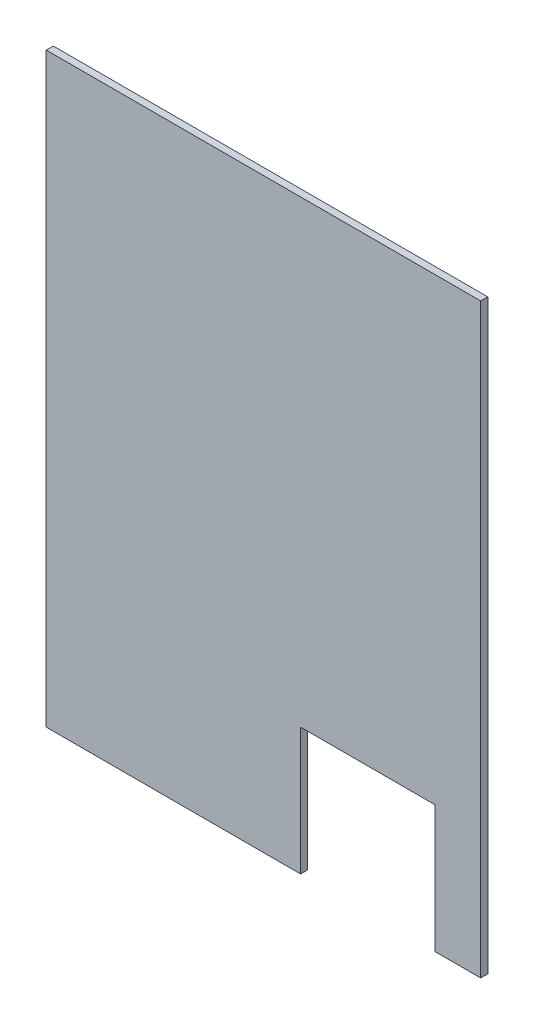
ISO-10303-21;
HEADER;
FILE_DESCRIPTION(('STEP AP214'),'2;1');
FILE_NAME('part.step','',(''),(''),'','','');
FILE_SCHEMA(('AUTOMOTIVE_DESIGN { 1 0 10303 214 1 1 1 1 }'));
ENDSEC;
DATA;
#1=APPLICATION_CONTEXT('core data for automotive mechanical design processes');
#2=APPLICATION_PROTOCOL_DEFINITION('international standard','automotive_design',2000,#1);
#3=PRODUCT_CONTEXT('',#1,'mechanical');
#4=PRODUCT('Part','Part','',(#3));
#5=PRODUCT_RELATED_PRODUCT_CATEGORY('part','',(#4));
#6=PRODUCT_DEFINITION_FORMATION('','',#4);
#7=PRODUCT_DEFINITION_CONTEXT('part definition',#1,'design');
#8=PRODUCT_DEFINITION('design','',#6,#7);
#9=PRODUCT_DEFINITION_SHAPE('','',#8);
#10=(LENGTH_UNIT() NAMED_UNIT(*) SI_UNIT(.MILLI.,.METRE.));
#11=(NAMED_UNIT(*) PLANE_ANGLE_UNIT() SI_UNIT($,.RADIAN.));
#12=(NAMED_UNIT(*) SI_UNIT($,.STERADIAN.) SOLID_ANGLE_UNIT());
#13=UNCERTAINTY_MEASURE_WITH_UNIT(LENGTH_MEASURE(1.E-05),#10,'distance_accuracy_value','');
#14=(GEOMETRIC_REPRESENTATION_CONTEXT(3) GLOBAL_UNCERTAINTY_ASSIGNED_CONTEXT((#13)) GLOBAL_UNIT_ASSIGNED_CONTEXT((#10,
#11,#12)) REPRESENTATION_CONTEXT('',''));
#15=CARTESIAN_POINT('',(0.,0.,0.));
#16=DIRECTION('',(0.,0.,1.));
#17=DIRECTION('',(1.,0.,0.));
#18=AXIS2_PLACEMENT_3D('',#15,#16,#17);
#19=CARTESIAN_POINT('',(0.,0.,10.));
#20=DIRECTION('',(1.,0.,0.));
#21=DIRECTION('',(0.,0.,-1.));
#22=AXIS2_PLACEMENT_3D('',#19,#20,#21);
#23=PLANE('',#22);
#24=DIRECTION('',(0.,-1.,0.));
#25=VECTOR('',#24,1.);
#26=CARTESIAN_POINT('',(0.,0.,0.));
#27=LINE('',#26,#25);
#28=CARTESIAN_POINT('',(0.,830.,0.));
#29=VERTEX_POINT('',#28);
#30=CARTESIAN_POINT('',(0.,0.,0.));
#31=VERTEX_POINT('',#30);
#32=EDGE_CURVE('E139',#29,#31,#27,.T.);
#33=ORIENTED_EDGE('',*,*,#32,.T.);
#34=DIRECTION('',(0.,0.,-1.));
#35=VECTOR('',#34,1.);
#36=CARTESIAN_POINT('',(0.,0.,10.));
#37=LINE('',#36,#35);
#38=CARTESIAN_POINT('',(0.,0.,10.));
#39=VERTEX_POINT('',#38);
#40=EDGE_CURVE('E11',#39,#31,#37,.T.);
#41=ORIENTED_EDGE('',*,*,#40,.F.);
#42=DIRECTION('',(0.,-1.,0.));
#43=VECTOR('',#42,1.);
#44=CARTESIAN_POINT('',(0.,0.,10.));
#45=LINE('',#44,#43);
#46=CARTESIAN_POINT('',(0.,830.,10.));
#47=VERTEX_POINT('',#46);
#48=EDGE_CURVE('E160',#47,#39,#45,.T.);
#49=ORIENTED_EDGE('',*,*,#48,.F.);
#50=DIRECTION('',(0.,0.,-1.));
#51=VECTOR('',#50,1.);
#52=CARTESIAN_POINT('',(0.,830.,10.));
#53=LINE('',#52,#51);
#54=EDGE_CURVE('E135',#47,#29,#53,.T.);
#55=ORIENTED_EDGE('',*,*,#54,.T.);
#56=EDGE_LOOP('',(#33,#41,#49,#55));
#57=FACE_BOUND('',#56,.T.);
#58=ADVANCED_FACE('F36',(#57),#23,.F.);
#59=CARTESIAN_POINT('',(0.,0.,10.));
#60=DIRECTION('',(0.,1.,0.));
#61=DIRECTION('',(-1.,0.,0.));
#62=AXIS2_PLACEMENT_3D('',#59,#60,#61);
#63=PLANE('',#62);
#64=DIRECTION('',(1.,0.,0.));
#65=VECTOR('',#64,1.);
#66=CARTESIAN_POINT('',(0.,0.,0.));
#67=LINE('',#66,#65);
#68=CARTESIAN_POINT('',(360.,0.,0.));
#69=VERTEX_POINT('',#68);
#70=EDGE_CURVE('E142',#31,#69,#67,.T.);
#71=ORIENTED_EDGE('',*,*,#70,.T.);
#72=DIRECTION('',(0.,0.,-1.));
#73=VECTOR('',#72,1.);
#74=CARTESIAN_POINT('',(360.,0.,10.));
#75=LINE('',#74,#73);
#76=CARTESIAN_POINT('',(360.,0.,10.));
#77=VERTEX_POINT('',#76);
#78=EDGE_CURVE('E45',#77,#69,#75,.T.);
#79=ORIENTED_EDGE('',*,*,#78,.F.);
#80=DIRECTION('',(1.,0.,0.));
#81=VECTOR('',#80,1.);
#82=CARTESIAN_POINT('',(0.,0.,10.));
#83=LINE('',#82,#81);
#84=EDGE_CURVE('E96',#39,#77,#83,.T.);
#85=ORIENTED_EDGE('',*,*,#84,.F.);
#86=ORIENTED_EDGE('',*,*,#40,.T.);
#87=EDGE_LOOP('',(#71,#79,#85,#86));
#88=FACE_BOUND('',#87,.T.);
#89=ADVANCED_FACE('F205',(#88),#63,.F.);
#90=CARTESIAN_POINT('',(360.,0.,10.));
#91=DIRECTION('',(-1.,0.,0.));
#92=DIRECTION('',(0.,-1.,0.));
#93=AXIS2_PLACEMENT_3D('',#90,#91,#92);
#94=PLANE('',#93);
#95=DIRECTION('',(0.,1.,0.));
#96=VECTOR('',#95,1.);
#97=CARTESIAN_POINT('',(360.,0.,0.));
#98=LINE('',#97,#96);
#99=CARTESIAN_POINT('',(360.,180.,0.));
#100=VERTEX_POINT('',#99);
#101=EDGE_CURVE('E145',#69,#100,#98,.T.);
#102=ORIENTED_EDGE('',*,*,#101,.T.);
#103=DIRECTION('',(0.,0.,-1.));
#104=VECTOR('',#103,1.);
#105=CARTESIAN_POINT('',(360.,180.,10.));
#106=LINE('',#105,#104);
#107=CARTESIAN_POINT('',(360.,180.,10.));
#108=VERTEX_POINT('',#107);
#109=EDGE_CURVE('E171',#108,#100,#106,.T.);
#110=ORIENTED_EDGE('',*,*,#109,.F.);
#111=DIRECTION('',(0.,1.,0.));
#112=VECTOR('',#111,1.);
#113=CARTESIAN_POINT('',(360.,0.,10.));
#114=LINE('',#113,#112);
#115=EDGE_CURVE('E181',#77,#108,#114,.T.);
#116=ORIENTED_EDGE('',*,*,#115,.F.);
#117=ORIENTED_EDGE('',*,*,#78,.T.);
#118=EDGE_LOOP('',(#102,#110,#116,#117));
#119=FACE_BOUND('',#118,.T.);
#120=ADVANCED_FACE('F179',(#119),#94,.F.);
#121=CARTESIAN_POINT('',(360.,180.,10.));
#122=DIRECTION('',(0.,1.,0.));
#123=DIRECTION('',(-1.,0.,0.));
#124=AXIS2_PLACEMENT_3D('',#121,#122,#123);
#125=PLANE('',#124);
#126=DIRECTION('',(1.,0.,0.));
#127=VECTOR('',#126,1.);
#128=CARTESIAN_POINT('',(360.,180.,0.));
#129=LINE('',#128,#127);
#130=CARTESIAN_POINT('',(550.,180.,0.));
#131=VERTEX_POINT('',#130);
#132=EDGE_CURVE('E148',#100,#131,#129,.T.);
#133=ORIENTED_EDGE('',*,*,#132,.T.);
#134=DIRECTION('',(0.,0.,-1.));
#135=VECTOR('',#134,1.);
#136=CARTESIAN_POINT('',(550.,180.,10.));
#137=LINE('',#136,#135);
#138=CARTESIAN_POINT('',(550.,180.,10.));
#139=VERTEX_POINT('',#138);
#140=EDGE_CURVE('E167',#139,#131,#137,.T.);
#141=ORIENTED_EDGE('',*,*,#140,.F.);
#142=DIRECTION('',(1.,0.,0.));
#143=VECTOR('',#142,1.);
#144=CARTESIAN_POINT('',(360.,180.,10.));
#145=LINE('',#144,#143);
#146=EDGE_CURVE('E194',#108,#139,#145,.T.);
#147=ORIENTED_EDGE('',*,*,#146,.F.);
#148=ORIENTED_EDGE('',*,*,#109,.T.);
#149=EDGE_LOOP('',(#133,#141,#147,#148));
#150=FACE_BOUND('',#149,.T.);
#151=ADVANCED_FACE('F189',(#150),#125,.F.);
#152=CARTESIAN_POINT('',(550.,180.,10.));
#153=DIRECTION('',(1.,0.,0.));
#154=DIRECTION('',(0.,1.,0.));
#155=AXIS2_PLACEMENT_3D('',#152,#153,#154);
#156=PLANE('',#155);
#157=DIRECTION('',(0.,-1.,0.));
#158=VECTOR('',#157,1.);
#159=CARTESIAN_POINT('',(550.,180.,0.));
#160=LINE('',#159,#158);
#161=CARTESIAN_POINT('',(550.,0.,0.));
#162=VERTEX_POINT('',#161);
#163=EDGE_CURVE('E151',#131,#162,#160,.T.);
#164=ORIENTED_EDGE('',*,*,#163,.T.);
#165=DIRECTION('',(0.,0.,-1.));
#166=VECTOR('',#165,1.);
#167=CARTESIAN_POINT('',(550.,0.,10.));
#168=LINE('',#167,#166);
#169=CARTESIAN_POINT('',(550.,0.,10.));
#170=VERTEX_POINT('',#169);
#171=EDGE_CURVE('E126',#170,#162,#168,.T.);
#172=ORIENTED_EDGE('',*,*,#171,.F.);
#173=DIRECTION('',(0.,-1.,0.));
#174=VECTOR('',#173,1.);
#175=CARTESIAN_POINT('',(550.,180.,10.));
#176=LINE('',#175,#174);
#177=EDGE_CURVE('E115',#139,#170,#176,.T.);
#178=ORIENTED_EDGE('',*,*,#177,.F.);
#179=ORIENTED_EDGE('',*,*,#140,.T.);
#180=EDGE_LOOP('',(#164,#172,#178,#179));
#181=FACE_BOUND('',#180,.T.);
#182=ADVANCED_FACE('F192',(#181),#156,.F.);
#183=CARTESIAN_POINT('',(550.,0.,10.));
#184=DIRECTION('',(0.,1.,0.));
#185=DIRECTION('',(-1.,0.,0.));
#186=AXIS2_PLACEMENT_3D('',#183,#184,#185);
#187=PLANE('',#186);
#188=DIRECTION('',(1.,0.,0.));
#189=VECTOR('',#188,1.);
#190=CARTESIAN_POINT('',(550.,0.,0.));
#191=LINE('',#190,#189);
#192=CARTESIAN_POINT('',(615.,0.,0.));
#193=VERTEX_POINT('',#192);
#194=EDGE_CURVE('E124',#162,#193,#191,.T.);
#195=ORIENTED_EDGE('',*,*,#194,.T.);
#196=DIRECTION('',(0.,0.,-1.));
#197=VECTOR('',#196,1.);
#198=CARTESIAN_POINT('',(615.,0.,10.));
#199=LINE('',#198,#197);
#200=CARTESIAN_POINT('',(615.,0.,10.));
#201=VERTEX_POINT('',#200);
#202=EDGE_CURVE('E121',#201,#193,#199,.T.);
#203=ORIENTED_EDGE('',*,*,#202,.F.);
#204=DIRECTION('',(1.,0.,0.));
#205=VECTOR('',#204,1.);
#206=CARTESIAN_POINT('',(550.,0.,10.));
#207=LINE('',#206,#205);
#208=EDGE_CURVE('E109',#170,#201,#207,.T.);
#209=ORIENTED_EDGE('',*,*,#208,.F.);
#210=ORIENTED_EDGE('',*,*,#171,.T.);
#211=EDGE_LOOP('',(#195,#203,#209,#210));
#212=FACE_BOUND('',#211,.T.);
#213=ADVANCED_FACE('F122',(#212),#187,.F.);
#214=CARTESIAN_POINT('',(615.,0.,10.));
#215=DIRECTION('',(-1.,0.,0.));
#216=DIRECTION('',(0.,0.,1.));
#217=AXIS2_PLACEMENT_3D('',#214,#215,#216);
#218=PLANE('',#217);
#219=DIRECTION('',(0.,1.,0.));
#220=VECTOR('',#219,1.);
#221=CARTESIAN_POINT('',(615.,0.,0.));
#222=LINE('',#221,#220);
#223=CARTESIAN_POINT('',(615.,830.,0.));
#224=VERTEX_POINT('',#223);
#225=EDGE_CURVE('E82',#193,#224,#222,.T.);
#226=ORIENTED_EDGE('',*,*,#225,.T.);
#227=DIRECTION('',(0.,0.,-1.));
#228=VECTOR('',#227,1.);
#229=CARTESIAN_POINT('',(615.,830.,10.));
#230=LINE('',#229,#228);
#231=CARTESIAN_POINT('',(615.,830.,10.));
#232=VERTEX_POINT('',#231);
#233=EDGE_CURVE('E127',#232,#224,#230,.T.);
#234=ORIENTED_EDGE('',*,*,#233,.F.);
#235=DIRECTION('',(0.,1.,0.));
#236=VECTOR('',#235,1.);
#237=CARTESIAN_POINT('',(615.,0.,10.));
#238=LINE('',#237,#236);
#239=EDGE_CURVE('E113',#201,#232,#238,.T.);
#240=ORIENTED_EDGE('',*,*,#239,.F.);
#241=ORIENTED_EDGE('',*,*,#202,.T.);
#242=EDGE_LOOP('',(#226,#234,#240,#241));
#243=FACE_BOUND('',#242,.T.);
#244=ADVANCED_FACE('F129',(#243),#218,.F.);
#245=CARTESIAN_POINT('',(0.,830.,10.));
#246=DIRECTION('',(0.,-1.,0.));
#247=DIRECTION('',(0.,0.,-1.));
#248=AXIS2_PLACEMENT_3D('',#245,#246,#247);
#249=PLANE('',#248);
#250=DIRECTION('',(-1.,0.,0.));
#251=VECTOR('',#250,1.);
#252=CARTESIAN_POINT('',(0.,830.,0.));
#253=LINE('',#252,#251);
#254=EDGE_CURVE('E88',#224,#29,#253,.T.);
#255=ORIENTED_EDGE('',*,*,#254,.T.);
#256=ORIENTED_EDGE('',*,*,#54,.F.);
#257=DIRECTION('',(-1.,0.,0.));
#258=VECTOR('',#257,1.);
#259=CARTESIAN_POINT('',(0.,830.,10.));
#260=LINE('',#259,#258);
#261=EDGE_CURVE('E53',#232,#47,#260,.T.);
#262=ORIENTED_EDGE('',*,*,#261,.F.);
#263=ORIENTED_EDGE('',*,*,#233,.T.);
#264=EDGE_LOOP('',(#255,#256,#262,#263));
#265=FACE_BOUND('',#264,.T.);
#266=ADVANCED_FACE('F221',(#265),#249,.F.);
#267=CARTESIAN_POINT('',(0.,830.,10.));
#268=DIRECTION('',(0.,0.,-1.));
#269=DIRECTION('',(-1.,0.,0.));
#270=AXIS2_PLACEMENT_3D('',#267,#268,#269);
#271=PLANE('',#270);
#272=ORIENTED_EDGE('',*,*,#48,.T.);
#273=ORIENTED_EDGE('',*,*,#84,.T.);
#274=ORIENTED_EDGE('',*,*,#115,.T.);
#275=ORIENTED_EDGE('',*,*,#146,.T.);
#276=ORIENTED_EDGE('',*,*,#177,.T.);
#277=ORIENTED_EDGE('',*,*,#208,.T.);
#278=ORIENTED_EDGE('',*,*,#239,.T.);
#279=ORIENTED_EDGE('',*,*,#261,.T.);
#280=EDGE_LOOP('',(#272,#273,#274,#275,#276,#277,#278,#279));
#281=FACE_BOUND('',#280,.T.);
#282=ADVANCED_FACE('F111',(#281),#271,.F.);
#283=CARTESIAN_POINT('',(0.,830.,0.));
#284=DIRECTION('',(0.,0.,-1.));
#285=DIRECTION('',(-1.,0.,0.));
#286=AXIS2_PLACEMENT_3D('',#283,#284,#285);
#287=PLANE('',#286);
#288=ORIENTED_EDGE('',*,*,#32,.F.);
#289=ORIENTED_EDGE('',*,*,#254,.F.);
#290=ORIENTED_EDGE('',*,*,#225,.F.);
#291=ORIENTED_EDGE('',*,*,#194,.F.);
#292=ORIENTED_EDGE('',*,*,#163,.F.);
#293=ORIENTED_EDGE('',*,*,#132,.F.);
#294=ORIENTED_EDGE('',*,*,#101,.F.);
#295=ORIENTED_EDGE('',*,*,#70,.F.);
#296=EDGE_LOOP('',(#288,#289,#290,#291,#292,#293,#294,#295));
#297=FACE_BOUND('',#296,.T.);
#298=ADVANCED_FACE('F185',(#297),#287,.T.);
#299=CLOSED_SHELL('',(#58,#89,#120,#151,#182,#213,#244,#266,#282,#298));
#300=MANIFOLD_SOLID_BREP('B2',#299);
#301=ADVANCED_BREP_SHAPE_REPRESENTATION('',(#18,#300),#14);
#302=SHAPE_DEFINITION_REPRESENTATION(#9,#301);
ENDSEC;
END-ISO-10303-21;
